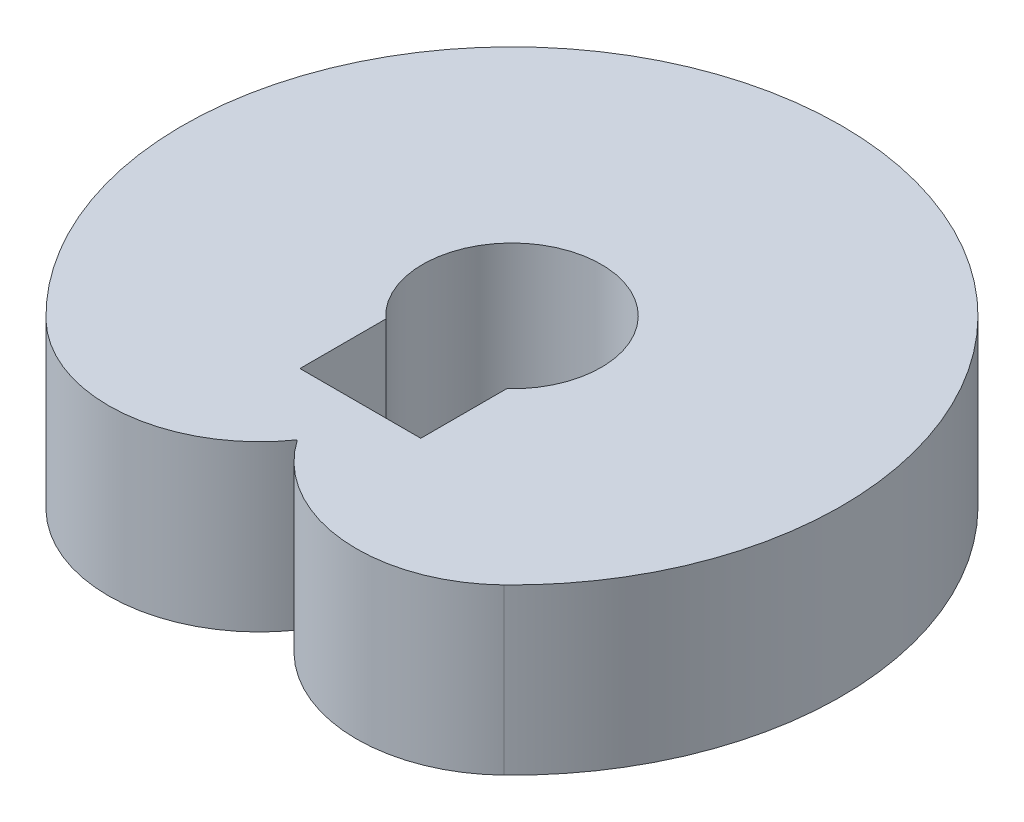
from build123d import *

# Parameters (mm, degrees)
SKETCH_1_R          = 162.628284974
EXTRUDE_1_DEPTH     = 300
SKETCH_2_W          = 220
SKETCH_2_H          = 156.217033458
CUT_EXTRUDE_1_DEPTH = 901


with BuildPart() as part:
    # Sketch 1 → Extrude 1 (new body)
    with BuildSketch(Plane(origin=(0, 0, 0), x_dir=(1, 0, 0), z_dir=(0, 1, 0))):
        with BuildLine():
            ThreePointArc((416.795022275, -431.603880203), (0, 600), (-416.795022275, -431.603880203))
            ThreePointArc((-416.795022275, -431.603880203), (-198.974056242, -507.477416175), (0, -390.806547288))
            ThreePointArc((0, -390.806547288), (198.974056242, -507.477416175), (416.795022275, -431.603880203))
        make_face()
        with Locations(Location((0, 0, 0), (0, 0, 270))):
            Circle(SKETCH_1_R, mode=Mode.SUBTRACT)
    extrude(amount=-EXTRUDE_1_DEPTH)

    # Sketch 2 → Cut-Extrude 1 (cut, through all)
    with BuildSketch(Plane(origin=(0, 0, 0), x_dir=(1, 0, 0), z_dir=(0, 1, 0))):
        with Locations((0, -197.891483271)):
            Rectangle(SKETCH_2_W, SKETCH_2_H)
    extrude(amount=-CUT_EXTRUDE_1_DEPTH, mode=Mode.SUBTRACT)


solid = part.part
